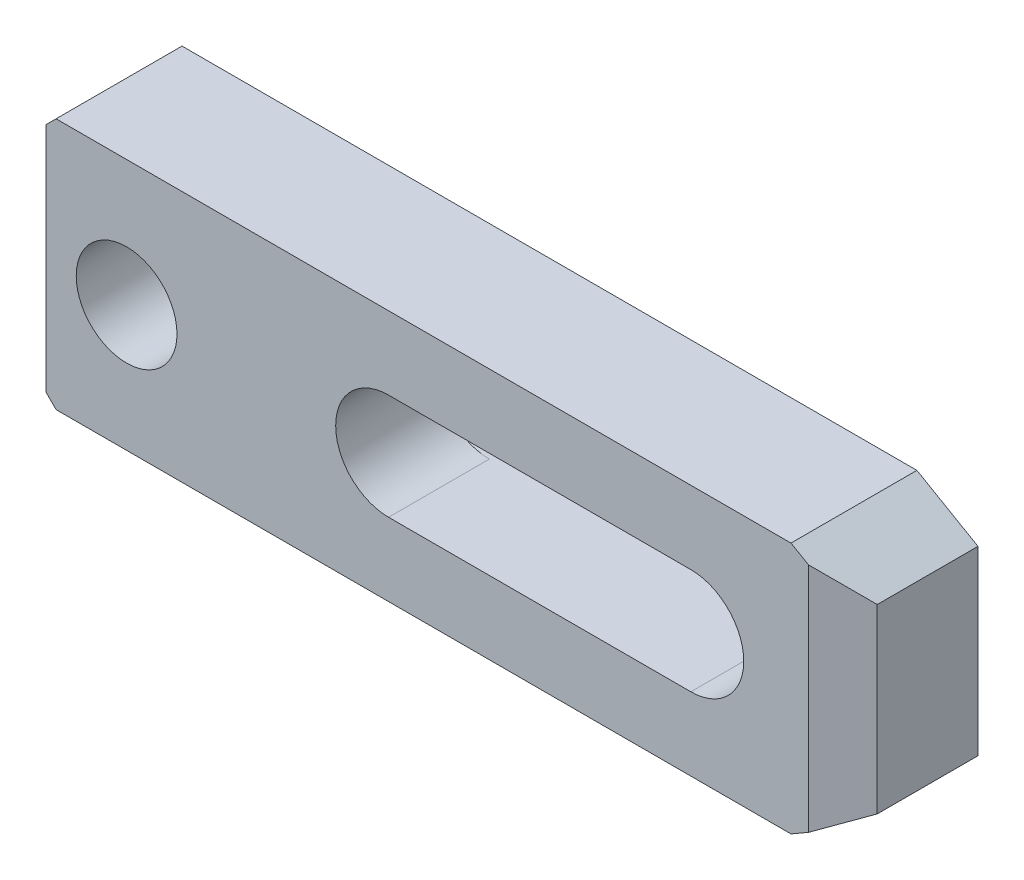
ISO-10303-21;
HEADER;
FILE_DESCRIPTION(('STEP AP214'),'2;1');
FILE_NAME('part.step','',(''),(''),'','','');
FILE_SCHEMA(('AUTOMOTIVE_DESIGN { 1 0 10303 214 1 1 1 1 }'));
ENDSEC;
DATA;
#1=APPLICATION_CONTEXT('core data for automotive mechanical design processes');
#2=APPLICATION_PROTOCOL_DEFINITION('international standard','automotive_design',2000,#1);
#3=PRODUCT_CONTEXT('',#1,'mechanical');
#4=PRODUCT('Part','Part','',(#3));
#5=PRODUCT_RELATED_PRODUCT_CATEGORY('part','',(#4));
#6=PRODUCT_DEFINITION_FORMATION('','',#4);
#7=PRODUCT_DEFINITION_CONTEXT('part definition',#1,'design');
#8=PRODUCT_DEFINITION('design','',#6,#7);
#9=PRODUCT_DEFINITION_SHAPE('','',#8);
#10=(LENGTH_UNIT() NAMED_UNIT(*) SI_UNIT(.MILLI.,.METRE.));
#11=(NAMED_UNIT(*) PLANE_ANGLE_UNIT() SI_UNIT($,.RADIAN.));
#12=(NAMED_UNIT(*) SI_UNIT($,.STERADIAN.) SOLID_ANGLE_UNIT());
#13=UNCERTAINTY_MEASURE_WITH_UNIT(LENGTH_MEASURE(1.E-05),#10,'distance_accuracy_value','');
#14=(GEOMETRIC_REPRESENTATION_CONTEXT(3) GLOBAL_UNCERTAINTY_ASSIGNED_CONTEXT((#13)) GLOBAL_UNIT_ASSIGNED_CONTEXT((#10,
#11,#12)) REPRESENTATION_CONTEXT('',''));
#15=CARTESIAN_POINT('',(0.,0.,0.));
#16=DIRECTION('',(0.,0.,1.));
#17=DIRECTION('',(1.,0.,0.));
#18=AXIS2_PLACEMENT_3D('',#15,#16,#17);
#19=CARTESIAN_POINT('',(-72.6058083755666,78.3941916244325,0.));
#20=DIRECTION('',(0.,0.,1.));
#21=DIRECTION('',(-1.,0.,0.));
#22=AXIS2_PLACEMENT_3D('',#19,#20,#21);
#23=PLANE('',#22);
#24=DIRECTION('',(0.,1.,0.));
#25=VECTOR('',#24,1.);
#26=CARTESIAN_POINT('',(-128.,-23.,0.));
#27=LINE('',#26,#25);
#28=CARTESIAN_POINT('',(-128.,-23.,0.));
#29=VERTEX_POINT('',#28);
#30=CARTESIAN_POINT('',(-128.,-10.5,0.));
#31=VERTEX_POINT('',#30);
#32=EDGE_CURVE('E147',#29,#31,#27,.T.);
#33=ORIENTED_EDGE('',*,*,#32,.T.);
#34=DIRECTION('',(-1.,0.,0.));
#35=VECTOR('',#34,1.);
#36=CARTESIAN_POINT('',(0.,-10.5,0.));
#37=LINE('',#36,#35);
#38=CARTESIAN_POINT('',(0.,-10.5,0.));
#39=VERTEX_POINT('',#38);
#40=EDGE_CURVE('E237',#39,#31,#37,.T.);
#41=ORIENTED_EDGE('',*,*,#40,.F.);
#42=CARTESIAN_POINT('',(0.,0.,0.));
#43=DIRECTION('',(0.,0.,1.));
#44=DIRECTION('',(-1.,0.,0.));
#45=AXIS2_PLACEMENT_3D('',#42,#43,#44);
#46=CIRCLE('',#45,10.5);
#47=CARTESIAN_POINT('',(0.,10.5,0.));
#48=VERTEX_POINT('',#47);
#49=EDGE_CURVE('E128',#39,#48,#46,.T.);
#50=ORIENTED_EDGE('',*,*,#49,.T.);
#51=DIRECTION('',(1.,0.,0.));
#52=VECTOR('',#51,1.);
#53=CARTESIAN_POINT('',(-60.,10.5,0.));
#54=LINE('',#53,#52);
#55=CARTESIAN_POINT('',(-128.,10.5,0.));
#56=VERTEX_POINT('',#55);
#57=EDGE_CURVE('E119',#56,#48,#54,.T.);
#58=ORIENTED_EDGE('',*,*,#57,.F.);
#59=CARTESIAN_POINT('',(-128.,23.,0.));
#60=VERTEX_POINT('',#59);
#61=EDGE_CURVE('E124',#56,#60,#27,.T.);
#62=ORIENTED_EDGE('',*,*,#61,.T.);
#63=DIRECTION('',(-0.707106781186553,-0.707106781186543,0.));
#64=VECTOR('',#63,1.);
#65=CARTESIAN_POINT('',(-126.,25.,0.));
#66=LINE('',#65,#64);
#67=CARTESIAN_POINT('',(-126.,25.,0.));
#68=VERTEX_POINT('',#67);
#69=EDGE_CURVE('E148',#68,#60,#66,.T.);
#70=ORIENTED_EDGE('',*,*,#69,.F.);
#71=DIRECTION('',(-1.,0.,0.));
#72=VECTOR('',#71,1.);
#73=CARTESIAN_POINT('',(19.875644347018,25.,0.));
#74=LINE('',#73,#72);
#75=CARTESIAN_POINT('',(19.875644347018,25.,0.));
#76=VERTEX_POINT('',#75);
#77=EDGE_CURVE('E151',#76,#68,#74,.T.);
#78=ORIENTED_EDGE('',*,*,#77,.F.);
#79=DIRECTION('',(-0.866025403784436,0.5,0.));
#80=VECTOR('',#79,1.);
#81=CARTESIAN_POINT('',(32.,18.,0.));
#82=LINE('',#81,#80);
#83=CARTESIAN_POINT('',(32.,18.,0.));
#84=VERTEX_POINT('',#83);
#85=EDGE_CURVE('E158',#84,#76,#82,.T.);
#86=ORIENTED_EDGE('',*,*,#85,.F.);
#87=DIRECTION('',(0.,-1.,0.));
#88=VECTOR('',#87,1.);
#89=CARTESIAN_POINT('',(32.,18.,0.));
#90=LINE('',#89,#88);
#91=CARTESIAN_POINT('',(32.,-18.,0.));
#92=VERTEX_POINT('',#91);
#93=EDGE_CURVE('E181',#84,#92,#90,.T.);
#94=ORIENTED_EDGE('',*,*,#93,.T.);
#95=DIRECTION('',(-0.86602540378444,-0.5,0.));
#96=VECTOR('',#95,1.);
#97=CARTESIAN_POINT('',(32.,-18.,0.));
#98=LINE('',#97,#96);
#99=CARTESIAN_POINT('',(19.8756443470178,-25.,0.));
#100=VERTEX_POINT('',#99);
#101=EDGE_CURVE('E208',#92,#100,#98,.T.);
#102=ORIENTED_EDGE('',*,*,#101,.T.);
#103=DIRECTION('',(-1.,0.,0.));
#104=VECTOR('',#103,1.);
#105=CARTESIAN_POINT('',(19.8756443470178,-25.,0.));
#106=LINE('',#105,#104);
#107=CARTESIAN_POINT('',(-126.,-25.,0.));
#108=VERTEX_POINT('',#107);
#109=EDGE_CURVE('E210',#100,#108,#106,.T.);
#110=ORIENTED_EDGE('',*,*,#109,.T.);
#111=DIRECTION('',(-0.707106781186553,0.707106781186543,0.));
#112=VECTOR('',#111,1.);
#113=CARTESIAN_POINT('',(-126.,-25.,0.));
#114=LINE('',#113,#112);
#115=EDGE_CURVE('E150',#108,#29,#114,.T.);
#116=ORIENTED_EDGE('',*,*,#115,.T.);
#117=EDGE_LOOP('',(#33,#41,#50,#58,#62,#70,#78,#86,#94,#102,#110,#116));
#118=FACE_BOUND('',#117,.T.);
#119=ADVANCED_FACE('F14',(#118),#23,.F.);
#120=CARTESIAN_POINT('',(-128.,-23.,25.));
#121=DIRECTION('',(-1.,0.,0.));
#122=DIRECTION('',(0.,0.,-1.));
#123=AXIS2_PLACEMENT_3D('',#120,#121,#122);
#124=PLANE('',#123);
#125=DIRECTION('',(0.,-1.,0.));
#126=VECTOR('',#125,1.);
#127=CARTESIAN_POINT('',(-128.,-23.,5.));
#128=LINE('',#127,#126);
#129=CARTESIAN_POINT('',(-128.,10.5,5.));
#130=VERTEX_POINT('',#129);
#131=CARTESIAN_POINT('',(-128.,-10.5,5.));
#132=VERTEX_POINT('',#131);
#133=EDGE_CURVE('E141',#130,#132,#128,.T.);
#134=ORIENTED_EDGE('',*,*,#133,.T.);
#135=DIRECTION('',(0.,0.,-1.));
#136=VECTOR('',#135,1.);
#137=CARTESIAN_POINT('',(-128.,-10.5,25.));
#138=LINE('',#137,#136);
#139=EDGE_CURVE('E140',#132,#31,#138,.T.);
#140=ORIENTED_EDGE('',*,*,#139,.T.);
#141=ORIENTED_EDGE('',*,*,#32,.F.);
#142=DIRECTION('',(0.,0.,-1.));
#143=VECTOR('',#142,1.);
#144=CARTESIAN_POINT('',(-128.,-23.,25.));
#145=LINE('',#144,#143);
#146=CARTESIAN_POINT('',(-128.,-23.,25.));
#147=VERTEX_POINT('',#146);
#148=EDGE_CURVE('E189',#147,#29,#145,.T.);
#149=ORIENTED_EDGE('',*,*,#148,.F.);
#150=DIRECTION('',(0.,1.,0.));
#151=VECTOR('',#150,1.);
#152=CARTESIAN_POINT('',(-128.,-23.,25.));
#153=LINE('',#152,#151);
#154=CARTESIAN_POINT('',(-128.,23.,25.));
#155=VERTEX_POINT('',#154);
#156=EDGE_CURVE('E171',#147,#155,#153,.T.);
#157=ORIENTED_EDGE('',*,*,#156,.T.);
#158=DIRECTION('',(0.,0.,-1.));
#159=VECTOR('',#158,1.);
#160=CARTESIAN_POINT('',(-128.,23.,25.));
#161=LINE('',#160,#159);
#162=EDGE_CURVE('E145',#155,#60,#161,.T.);
#163=ORIENTED_EDGE('',*,*,#162,.T.);
#164=ORIENTED_EDGE('',*,*,#61,.F.);
#165=DIRECTION('',(0.,0.,-1.));
#166=VECTOR('',#165,1.);
#167=CARTESIAN_POINT('',(-128.,10.5,25.));
#168=LINE('',#167,#166);
#169=EDGE_CURVE('E135',#130,#56,#168,.T.);
#170=ORIENTED_EDGE('',*,*,#169,.F.);
#171=EDGE_LOOP('',(#134,#140,#141,#149,#157,#163,#164,#170));
#172=FACE_BOUND('',#171,.T.);
#173=ADVANCED_FACE('F143',(#172),#124,.T.);
#174=CARTESIAN_POINT('',(-112.,0.,25.));
#175=DIRECTION('',(0.,0.,-1.));
#176=DIRECTION('',(1.,0.,0.));
#177=AXIS2_PLACEMENT_3D('',#174,#175,#176);
#178=CYLINDRICAL_SURFACE('',#177,10.);
#179=CARTESIAN_POINT('',(-112.,0.,25.));
#180=DIRECTION('',(0.,0.,1.));
#181=DIRECTION('',(-1.,0.,0.));
#182=AXIS2_PLACEMENT_3D('',#179,#180,#181);
#183=CIRCLE('',#182,10.);
#184=CARTESIAN_POINT('',(-122.,0.,25.));
#185=VERTEX_POINT('',#184);
#186=EDGE_CURVE('E161',#185,#185,#183,.T.);
#187=ORIENTED_EDGE('',*,*,#186,.T.);
#188=EDGE_LOOP('',(#187));
#189=FACE_BOUND('',#188,.T.);
#190=CARTESIAN_POINT('',(-112.,0.,5.));
#191=DIRECTION('',(0.,0.,-1.));
#192=DIRECTION('',(1.,0.,0.));
#193=AXIS2_PLACEMENT_3D('',#190,#191,#192);
#194=CIRCLE('',#193,10.);
#195=CARTESIAN_POINT('',(-102.,0.,5.));
#196=VERTEX_POINT('',#195);
#197=EDGE_CURVE('E425',#196,#196,#194,.T.);
#198=ORIENTED_EDGE('',*,*,#197,.T.);
#199=EDGE_LOOP('',(#198));
#200=FACE_BOUND('',#199,.T.);
#201=ADVANCED_FACE('F262',(#189,#200),#178,.F.);
#202=CARTESIAN_POINT('',(-60.,0.,25.));
#203=DIRECTION('',(0.,0.,-1.));
#204=DIRECTION('',(1.,0.,0.));
#205=AXIS2_PLACEMENT_3D('',#202,#203,#204);
#206=CYLINDRICAL_SURFACE('',#205,10.5);
#207=DIRECTION('',(0.,0.,-1.));
#208=VECTOR('',#207,1.);
#209=CARTESIAN_POINT('',(-60.,-10.5,25.));
#210=LINE('',#209,#208);
#211=CARTESIAN_POINT('',(-60.,-10.5,25.));
#212=VERTEX_POINT('',#211);
#213=CARTESIAN_POINT('',(-60.,-10.5,5.));
#214=VERTEX_POINT('',#213);
#215=EDGE_CURVE('E256',#212,#214,#210,.T.);
#216=ORIENTED_EDGE('',*,*,#215,.T.);
#217=CARTESIAN_POINT('',(-60.,0.,5.));
#218=DIRECTION('',(0.,0.,-1.));
#219=DIRECTION('',(1.,0.,0.));
#220=AXIS2_PLACEMENT_3D('',#217,#218,#219);
#221=CIRCLE('',#220,10.5);
#222=CARTESIAN_POINT('',(-60.,10.5,5.));
#223=VERTEX_POINT('',#222);
#224=EDGE_CURVE('E278',#214,#223,#221,.T.);
#225=ORIENTED_EDGE('',*,*,#224,.T.);
#226=DIRECTION('',(0.,0.,-1.));
#227=VECTOR('',#226,1.);
#228=CARTESIAN_POINT('',(-60.,10.5,25.));
#229=LINE('',#228,#227);
#230=CARTESIAN_POINT('',(-60.,10.5,25.));
#231=VERTEX_POINT('',#230);
#232=EDGE_CURVE('E244',#231,#223,#229,.T.);
#233=ORIENTED_EDGE('',*,*,#232,.F.);
#234=CARTESIAN_POINT('',(-60.,0.,25.));
#235=DIRECTION('',(0.,0.,1.));
#236=DIRECTION('',(-1.,0.,0.));
#237=AXIS2_PLACEMENT_3D('',#234,#235,#236);
#238=CIRCLE('',#237,10.5);
#239=EDGE_CURVE('E132',#231,#212,#238,.T.);
#240=ORIENTED_EDGE('',*,*,#239,.T.);
#241=EDGE_LOOP('',(#216,#225,#233,#240));
#242=FACE_BOUND('',#241,.T.);
#243=ADVANCED_FACE('F269',(#242),#206,.F.);
#244=CARTESIAN_POINT('',(-72.6058083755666,78.3941916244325,25.));
#245=DIRECTION('',(0.,0.,1.));
#246=DIRECTION('',(-1.,0.,0.));
#247=AXIS2_PLACEMENT_3D('',#244,#245,#246);
#248=PLANE('',#247);
#249=DIRECTION('',(0.,-1.,0.));
#250=VECTOR('',#249,1.);
#251=CARTESIAN_POINT('',(23.3397459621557,78.3941916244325,25.));
#252=LINE('',#251,#250);
#253=CARTESIAN_POINT('',(23.3397459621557,23.,25.));
#254=VERTEX_POINT('',#253);
#255=CARTESIAN_POINT('',(23.3397459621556,-23.,25.));
#256=VERTEX_POINT('',#255);
#257=EDGE_CURVE('E233',#254,#256,#252,.T.);
#258=ORIENTED_EDGE('',*,*,#257,.F.);
#259=DIRECTION('',(-0.866025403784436,0.5,0.));
#260=VECTOR('',#259,1.);
#261=CARTESIAN_POINT('',(32.,18.,25.));
#262=LINE('',#261,#260);
#263=CARTESIAN_POINT('',(19.875644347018,25.,25.));
#264=VERTEX_POINT('',#263);
#265=EDGE_CURVE('E179',#254,#264,#262,.T.);
#266=ORIENTED_EDGE('',*,*,#265,.T.);
#267=DIRECTION('',(-1.,0.,0.));
#268=VECTOR('',#267,1.);
#269=CARTESIAN_POINT('',(19.875644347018,25.,25.));
#270=LINE('',#269,#268);
#271=CARTESIAN_POINT('',(-126.,25.,25.));
#272=VERTEX_POINT('',#271);
#273=EDGE_CURVE('E176',#264,#272,#270,.T.);
#274=ORIENTED_EDGE('',*,*,#273,.T.);
#275=DIRECTION('',(-0.707106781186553,-0.707106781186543,0.));
#276=VECTOR('',#275,1.);
#277=CARTESIAN_POINT('',(-126.,25.,25.));
#278=LINE('',#277,#276);
#279=EDGE_CURVE('E173',#272,#155,#278,.T.);
#280=ORIENTED_EDGE('',*,*,#279,.T.);
#281=ORIENTED_EDGE('',*,*,#156,.F.);
#282=DIRECTION('',(-0.707106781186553,0.707106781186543,0.));
#283=VECTOR('',#282,1.);
#284=CARTESIAN_POINT('',(-126.,-25.,25.));
#285=LINE('',#284,#283);
#286=CARTESIAN_POINT('',(-126.,-25.,25.));
#287=VERTEX_POINT('',#286);
#288=EDGE_CURVE('E168',#287,#147,#285,.T.);
#289=ORIENTED_EDGE('',*,*,#288,.F.);
#290=DIRECTION('',(-1.,0.,0.));
#291=VECTOR('',#290,1.);
#292=CARTESIAN_POINT('',(19.8756443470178,-25.,25.));
#293=LINE('',#292,#291);
#294=CARTESIAN_POINT('',(19.8756443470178,-25.,25.));
#295=VERTEX_POINT('',#294);
#296=EDGE_CURVE('E165',#295,#287,#293,.T.);
#297=ORIENTED_EDGE('',*,*,#296,.F.);
#298=DIRECTION('',(-0.86602540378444,-0.5,0.));
#299=VECTOR('',#298,1.);
#300=CARTESIAN_POINT('',(32.,-18.,25.));
#301=LINE('',#300,#299);
#302=EDGE_CURVE('E162',#256,#295,#301,.T.);
#303=ORIENTED_EDGE('',*,*,#302,.F.);
#304=EDGE_LOOP('',(#258,#266,#274,#280,#281,#289,#297,#303));
#305=FACE_BOUND('',#304,.T.);
#306=ORIENTED_EDGE('',*,*,#186,.F.);
#307=EDGE_LOOP('',(#306));
#308=FACE_BOUND('',#307,.T.);
#309=DIRECTION('',(-1.,0.,0.));
#310=VECTOR('',#309,1.);
#311=CARTESIAN_POINT('',(0.,-10.5,25.));
#312=LINE('',#311,#310);
#313=CARTESIAN_POINT('',(0.,-10.5,25.));
#314=VERTEX_POINT('',#313);
#315=EDGE_CURVE('E247',#314,#212,#312,.T.);
#316=ORIENTED_EDGE('',*,*,#315,.T.);
#317=ORIENTED_EDGE('',*,*,#239,.F.);
#318=DIRECTION('',(1.,0.,0.));
#319=VECTOR('',#318,1.);
#320=CARTESIAN_POINT('',(-60.,10.5,25.));
#321=LINE('',#320,#319);
#322=CARTESIAN_POINT('',(0.,10.5,25.));
#323=VERTEX_POINT('',#322);
#324=EDGE_CURVE('E241',#231,#323,#321,.T.);
#325=ORIENTED_EDGE('',*,*,#324,.T.);
#326=CARTESIAN_POINT('',(0.,0.,25.));
#327=DIRECTION('',(0.,0.,1.));
#328=DIRECTION('',(-1.,0.,0.));
#329=AXIS2_PLACEMENT_3D('',#326,#327,#328);
#330=CIRCLE('',#329,10.5);
#331=EDGE_CURVE('E245',#314,#323,#330,.T.);
#332=ORIENTED_EDGE('',*,*,#331,.F.);
#333=EDGE_LOOP('',(#316,#317,#325,#332));
#334=FACE_BOUND('',#333,.T.);
#335=ADVANCED_FACE('F265',(#305,#308,#334),#248,.T.);
#336=CARTESIAN_POINT('',(32.,18.,25.));
#337=DIRECTION('',(-0.5,-0.866025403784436,0.));
#338=DIRECTION('',(0.866025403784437,-0.5,0.));
#339=AXIS2_PLACEMENT_3D('',#336,#337,#338);
#340=PLANE('',#339);
#341=ORIENTED_EDGE('',*,*,#265,.F.);
#342=DIRECTION('',(0.774596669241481,-0.447213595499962,-0.447213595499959));
#343=VECTOR('',#342,1.);
#344=CARTESIAN_POINT('',(30.2679491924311,19.,21.));
#345=LINE('',#344,#343);
#346=CARTESIAN_POINT('',(32.,18.,20.));
#347=VERTEX_POINT('',#346);
#348=EDGE_CURVE('E235',#254,#347,#345,.T.);
#349=ORIENTED_EDGE('',*,*,#348,.T.);
#350=DIRECTION('',(0.,0.,-1.));
#351=VECTOR('',#350,1.);
#352=CARTESIAN_POINT('',(32.,18.,25.));
#353=LINE('',#352,#351);
#354=EDGE_CURVE('E164',#347,#84,#353,.T.);
#355=ORIENTED_EDGE('',*,*,#354,.T.);
#356=ORIENTED_EDGE('',*,*,#85,.T.);
#357=DIRECTION('',(0.,0.,-1.));
#358=VECTOR('',#357,1.);
#359=CARTESIAN_POINT('',(19.875644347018,25.,25.));
#360=LINE('',#359,#358);
#361=EDGE_CURVE('E9',#264,#76,#360,.T.);
#362=ORIENTED_EDGE('',*,*,#361,.F.);
#363=EDGE_LOOP('',(#341,#349,#355,#356,#362));
#364=FACE_BOUND('',#363,.T.);
#365=ADVANCED_FACE('F268',(#364),#340,.F.);
#366=CARTESIAN_POINT('',(19.875644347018,25.,25.));
#367=DIRECTION('',(0.,-1.,0.));
#368=DIRECTION('',(0.,0.,1.));
#369=AXIS2_PLACEMENT_3D('',#366,#367,#368);
#370=PLANE('',#369);
#371=DIRECTION('',(0.,0.,-1.));
#372=VECTOR('',#371,1.);
#373=CARTESIAN_POINT('',(-126.,25.,25.));
#374=LINE('',#373,#372);
#375=EDGE_CURVE('E22',#272,#68,#374,.T.);
#376=ORIENTED_EDGE('',*,*,#375,.F.);
#377=ORIENTED_EDGE('',*,*,#273,.F.);
#378=ORIENTED_EDGE('',*,*,#361,.T.);
#379=ORIENTED_EDGE('',*,*,#77,.T.);
#380=EDGE_LOOP('',(#376,#377,#378,#379));
#381=FACE_BOUND('',#380,.T.);
#382=ADVANCED_FACE('F16',(#381),#370,.F.);
#383=CARTESIAN_POINT('',(-126.,25.,25.));
#384=DIRECTION('',(0.707106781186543,-0.707106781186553,0.));
#385=DIRECTION('',(0.707106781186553,0.707106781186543,0.));
#386=AXIS2_PLACEMENT_3D('',#383,#384,#385);
#387=PLANE('',#386);
#388=ORIENTED_EDGE('',*,*,#162,.F.);
#389=ORIENTED_EDGE('',*,*,#279,.F.);
#390=ORIENTED_EDGE('',*,*,#375,.T.);
#391=ORIENTED_EDGE('',*,*,#69,.T.);
#392=EDGE_LOOP('',(#388,#389,#390,#391));
#393=FACE_BOUND('',#392,.T.);
#394=ADVANCED_FACE('F193',(#393),#387,.F.);
#395=CARTESIAN_POINT('',(-126.,-25.,25.));
#396=DIRECTION('',(-0.707106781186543,-0.707106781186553,0.));
#397=DIRECTION('',(0.707106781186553,-0.707106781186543,0.));
#398=AXIS2_PLACEMENT_3D('',#395,#396,#397);
#399=PLANE('',#398);
#400=DIRECTION('',(0.,0.,-1.));
#401=VECTOR('',#400,1.);
#402=CARTESIAN_POINT('',(-126.,-25.,25.));
#403=LINE('',#402,#401);
#404=EDGE_CURVE('E187',#287,#108,#403,.T.);
#405=ORIENTED_EDGE('',*,*,#404,.F.);
#406=ORIENTED_EDGE('',*,*,#288,.T.);
#407=ORIENTED_EDGE('',*,*,#148,.T.);
#408=ORIENTED_EDGE('',*,*,#115,.F.);
#409=EDGE_LOOP('',(#405,#406,#407,#408));
#410=FACE_BOUND('',#409,.T.);
#411=ADVANCED_FACE('F220',(#410),#399,.T.);
#412=CARTESIAN_POINT('',(19.8756443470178,-25.,25.));
#413=DIRECTION('',(0.,-1.,0.));
#414=DIRECTION('',(1.,0.,0.));
#415=AXIS2_PLACEMENT_3D('',#412,#413,#414);
#416=PLANE('',#415);
#417=DIRECTION('',(0.,0.,-1.));
#418=VECTOR('',#417,1.);
#419=CARTESIAN_POINT('',(19.8756443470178,-25.,25.));
#420=LINE('',#419,#418);
#421=EDGE_CURVE('E185',#295,#100,#420,.T.);
#422=ORIENTED_EDGE('',*,*,#421,.F.);
#423=ORIENTED_EDGE('',*,*,#296,.T.);
#424=ORIENTED_EDGE('',*,*,#404,.T.);
#425=ORIENTED_EDGE('',*,*,#109,.F.);
#426=EDGE_LOOP('',(#422,#423,#424,#425));
#427=FACE_BOUND('',#426,.T.);
#428=ADVANCED_FACE('F306',(#427),#416,.T.);
#429=CARTESIAN_POINT('',(32.,-18.,25.));
#430=DIRECTION('',(0.5,-0.86602540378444,0.));
#431=DIRECTION('',(0.86602540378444,0.5,0.));
#432=AXIS2_PLACEMENT_3D('',#429,#430,#431);
#433=PLANE('',#432);
#434=DIRECTION('',(0.774596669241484,0.447213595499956,-0.44721359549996));
#435=VECTOR('',#434,1.);
#436=CARTESIAN_POINT('',(30.2679491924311,-19.,21.));
#437=LINE('',#436,#435);
#438=CARTESIAN_POINT('',(32.,-18.,20.));
#439=VERTEX_POINT('',#438);
#440=EDGE_CURVE('E37',#256,#439,#437,.T.);
#441=ORIENTED_EDGE('',*,*,#440,.F.);
#442=ORIENTED_EDGE('',*,*,#302,.T.);
#443=ORIENTED_EDGE('',*,*,#421,.T.);
#444=ORIENTED_EDGE('',*,*,#101,.F.);
#445=DIRECTION('',(0.,0.,-1.));
#446=VECTOR('',#445,1.);
#447=CARTESIAN_POINT('',(32.,-18.,25.));
#448=LINE('',#447,#446);
#449=EDGE_CURVE('E183',#439,#92,#448,.T.);
#450=ORIENTED_EDGE('',*,*,#449,.F.);
#451=EDGE_LOOP('',(#441,#442,#443,#444,#450));
#452=FACE_BOUND('',#451,.T.);
#453=ADVANCED_FACE('F303',(#452),#433,.T.);
#454=CARTESIAN_POINT('',(32.,18.,25.));
#455=DIRECTION('',(1.,0.,0.));
#456=DIRECTION('',(0.,0.,1.));
#457=AXIS2_PLACEMENT_3D('',#454,#455,#456);
#458=PLANE('',#457);
#459=DIRECTION('',(0.,-1.,0.));
#460=VECTOR('',#459,1.);
#461=CARTESIAN_POINT('',(32.,25.,20.));
#462=LINE('',#461,#460);
#463=EDGE_CURVE('E227',#347,#439,#462,.T.);
#464=ORIENTED_EDGE('',*,*,#463,.T.);
#465=ORIENTED_EDGE('',*,*,#449,.T.);
#466=ORIENTED_EDGE('',*,*,#93,.F.);
#467=ORIENTED_EDGE('',*,*,#354,.F.);
#468=EDGE_LOOP('',(#464,#465,#466,#467));
#469=FACE_BOUND('',#468,.T.);
#470=ADVANCED_FACE('F205',(#469),#458,.T.);
#471=CARTESIAN_POINT('',(0.,-10.5,25.));
#472=DIRECTION('',(0.,-1.,0.));
#473=DIRECTION('',(1.,0.,0.));
#474=AXIS2_PLACEMENT_3D('',#471,#472,#473);
#475=PLANE('',#474);
#476=ORIENTED_EDGE('',*,*,#40,.T.);
#477=ORIENTED_EDGE('',*,*,#139,.F.);
#478=DIRECTION('',(1.,0.,0.));
#479=VECTOR('',#478,1.);
#480=CARTESIAN_POINT('',(-138.,-10.5,5.));
#481=LINE('',#480,#479);
#482=EDGE_CURVE('E276',#132,#214,#481,.T.);
#483=ORIENTED_EDGE('',*,*,#482,.T.);
#484=ORIENTED_EDGE('',*,*,#215,.F.);
#485=ORIENTED_EDGE('',*,*,#315,.F.);
#486=DIRECTION('',(0.,0.,-1.));
#487=VECTOR('',#486,1.);
#488=CARTESIAN_POINT('',(0.,-10.5,25.));
#489=LINE('',#488,#487);
#490=EDGE_CURVE('E255',#314,#39,#489,.T.);
#491=ORIENTED_EDGE('',*,*,#490,.T.);
#492=EDGE_LOOP('',(#476,#477,#483,#484,#485,#491));
#493=FACE_BOUND('',#492,.T.);
#494=ADVANCED_FACE('F275',(#493),#475,.F.);
#495=CARTESIAN_POINT('',(0.,0.,25.));
#496=DIRECTION('',(0.,0.,-1.));
#497=DIRECTION('',(1.,0.,0.));
#498=AXIS2_PLACEMENT_3D('',#495,#496,#497);
#499=CYLINDRICAL_SURFACE('',#498,10.5);
#500=DIRECTION('',(0.,0.,-1.));
#501=VECTOR('',#500,1.);
#502=CARTESIAN_POINT('',(0.,10.5,25.));
#503=LINE('',#502,#501);
#504=EDGE_CURVE('E253',#323,#48,#503,.T.);
#505=ORIENTED_EDGE('',*,*,#504,.T.);
#506=ORIENTED_EDGE('',*,*,#49,.F.);
#507=ORIENTED_EDGE('',*,*,#490,.F.);
#508=ORIENTED_EDGE('',*,*,#331,.T.);
#509=EDGE_LOOP('',(#505,#506,#507,#508));
#510=FACE_BOUND('',#509,.T.);
#511=ADVANCED_FACE('F280',(#510),#499,.F.);
#512=CARTESIAN_POINT('',(-60.,10.5,25.));
#513=DIRECTION('',(0.,1.,0.));
#514=DIRECTION('',(-1.,0.,0.));
#515=AXIS2_PLACEMENT_3D('',#512,#513,#514);
#516=PLANE('',#515);
#517=ORIENTED_EDGE('',*,*,#57,.T.);
#518=ORIENTED_EDGE('',*,*,#504,.F.);
#519=ORIENTED_EDGE('',*,*,#324,.F.);
#520=ORIENTED_EDGE('',*,*,#232,.T.);
#521=DIRECTION('',(1.,0.,0.));
#522=VECTOR('',#521,1.);
#523=CARTESIAN_POINT('',(-138.,10.5,5.));
#524=LINE('',#523,#522);
#525=EDGE_CURVE('E29',#130,#223,#524,.T.);
#526=ORIENTED_EDGE('',*,*,#525,.F.);
#527=ORIENTED_EDGE('',*,*,#169,.T.);
#528=EDGE_LOOP('',(#517,#518,#519,#520,#526,#527));
#529=FACE_BOUND('',#528,.T.);
#530=ADVANCED_FACE('F136',(#529),#516,.F.);
#531=CARTESIAN_POINT('',(19.875644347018,25.,27.));
#532=DIRECTION('',(-0.5,0.,-0.866025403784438));
#533=DIRECTION('',(0.866025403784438,0.,-0.5));
#534=AXIS2_PLACEMENT_3D('',#531,#532,#533);
#535=PLANE('',#534);
#536=ORIENTED_EDGE('',*,*,#257,.T.);
#537=ORIENTED_EDGE('',*,*,#440,.T.);
#538=ORIENTED_EDGE('',*,*,#463,.F.);
#539=ORIENTED_EDGE('',*,*,#348,.F.);
#540=EDGE_LOOP('',(#536,#537,#538,#539));
#541=FACE_BOUND('',#540,.T.);
#542=ADVANCED_FACE('F288',(#541),#535,.F.);
#543=CARTESIAN_POINT('',(-138.,10.5,5.));
#544=DIRECTION('',(0.,0.,-1.));
#545=DIRECTION('',(1.,0.,0.));
#546=AXIS2_PLACEMENT_3D('',#543,#544,#545);
#547=PLANE('',#546);
#548=ORIENTED_EDGE('',*,*,#197,.F.);
#549=EDGE_LOOP('',(#548));
#550=FACE_BOUND('',#549,.T.);
#551=ORIENTED_EDGE('',*,*,#525,.T.);
#552=ORIENTED_EDGE('',*,*,#224,.F.);
#553=ORIENTED_EDGE('',*,*,#482,.F.);
#554=ORIENTED_EDGE('',*,*,#133,.F.);
#555=EDGE_LOOP('',(#551,#552,#553,#554));
#556=FACE_BOUND('',#555,.T.);
#557=ADVANCED_FACE('F410',(#550,#556),#547,.T.);
#558=CLOSED_SHELL('',(#119,#173,#201,#243,#335,#365,#382,#394,#411,#428,#453,#470,#494,#511,
#530,#542,#557));
#559=MANIFOLD_SOLID_BREP('B1',#558);
#560=ADVANCED_BREP_SHAPE_REPRESENTATION('',(#18,#559),#14);
#561=SHAPE_DEFINITION_REPRESENTATION(#9,#560);
ENDSEC;
END-ISO-10303-21;
